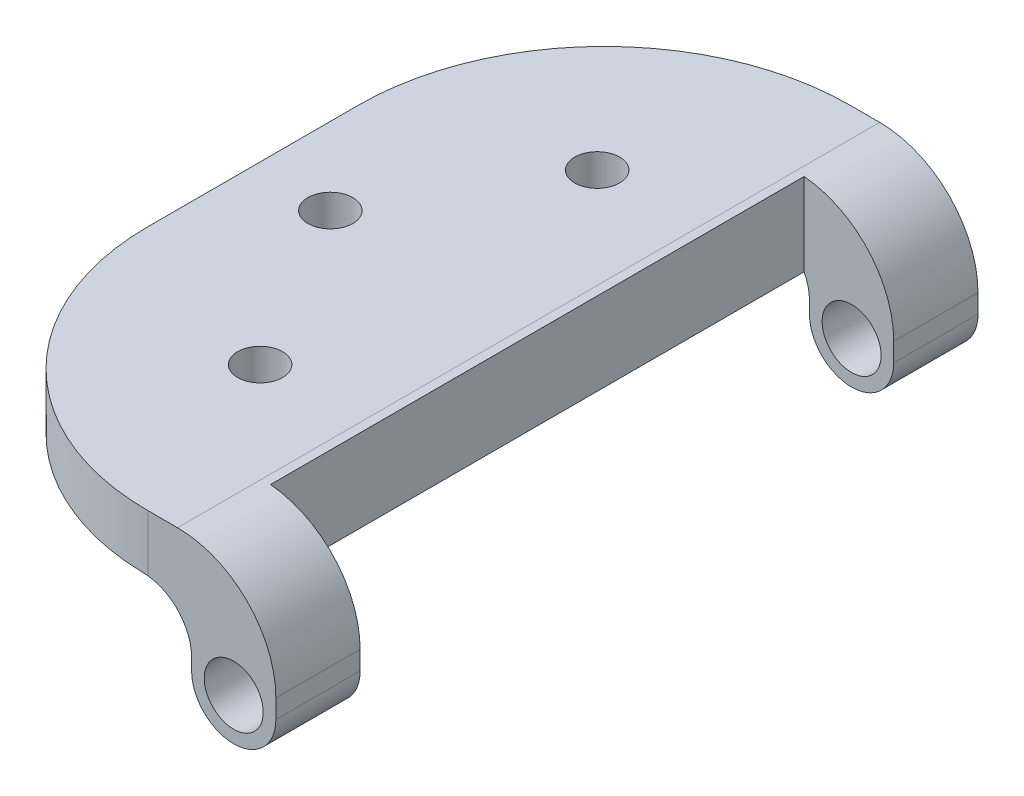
ISO-10303-21;
HEADER;
FILE_DESCRIPTION(('STEP AP214'),'2;1');
FILE_NAME('part.step','',(''),(''),'','','');
FILE_SCHEMA(('AUTOMOTIVE_DESIGN { 1 0 10303 214 1 1 1 1 }'));
ENDSEC;
DATA;
#1=APPLICATION_CONTEXT('core data for automotive mechanical design processes');
#2=APPLICATION_PROTOCOL_DEFINITION('international standard','automotive_design',2000,#1);
#3=PRODUCT_CONTEXT('',#1,'mechanical');
#4=PRODUCT('Part','Part','',(#3));
#5=PRODUCT_RELATED_PRODUCT_CATEGORY('part','',(#4));
#6=PRODUCT_DEFINITION_FORMATION('','',#4);
#7=PRODUCT_DEFINITION_CONTEXT('part definition',#1,'design');
#8=PRODUCT_DEFINITION('design','',#6,#7);
#9=PRODUCT_DEFINITION_SHAPE('','',#8);
#10=(LENGTH_UNIT() NAMED_UNIT(*) SI_UNIT(.MILLI.,.METRE.));
#11=(NAMED_UNIT(*) PLANE_ANGLE_UNIT() SI_UNIT($,.RADIAN.));
#12=(NAMED_UNIT(*) SI_UNIT($,.STERADIAN.) SOLID_ANGLE_UNIT());
#13=UNCERTAINTY_MEASURE_WITH_UNIT(LENGTH_MEASURE(1.E-05),#10,'distance_accuracy_value','');
#14=(GEOMETRIC_REPRESENTATION_CONTEXT(3) GLOBAL_UNCERTAINTY_ASSIGNED_CONTEXT((#13)) GLOBAL_UNIT_ASSIGNED_CONTEXT((#10,
#11,#12)) REPRESENTATION_CONTEXT('',''));
#15=CARTESIAN_POINT('',(0.,0.,0.));
#16=DIRECTION('',(0.,0.,1.));
#17=DIRECTION('',(1.,0.,0.));
#18=AXIS2_PLACEMENT_3D('',#15,#16,#17);
#19=CARTESIAN_POINT('',(6.12,-4.33,-25.));
#20=DIRECTION('',(0.,0.,1.));
#21=DIRECTION('',(1.,0.,0.));
#22=AXIS2_PLACEMENT_3D('',#19,#20,#21);
#23=CYLINDRICAL_SURFACE('',#22,3.);
#24=CARTESIAN_POINT('',(6.12,-4.33,19.));
#25=DIRECTION('',(0.,0.,1.));
#26=DIRECTION('',(1.,0.,0.));
#27=AXIS2_PLACEMENT_3D('',#24,#25,#26);
#28=CIRCLE('',#27,3.);
#29=CARTESIAN_POINT('',(9.12,-4.33,19.));
#30=VERTEX_POINT('',#29);
#31=CARTESIAN_POINT('',(3.12,-4.33,19.));
#32=VERTEX_POINT('',#31);
#33=EDGE_CURVE('E184',#30,#32,#28,.F.);
#34=ORIENTED_EDGE('',*,*,#33,.F.);
#35=DIRECTION('',(0.,0.,1.));
#36=VECTOR('',#35,1.);
#37=CARTESIAN_POINT('',(9.12,-4.33,-25.));
#38=LINE('',#37,#36);
#39=CARTESIAN_POINT('',(9.12,-4.33,25.));
#40=VERTEX_POINT('',#39);
#41=EDGE_CURVE('E224',#30,#40,#38,.T.);
#42=ORIENTED_EDGE('',*,*,#41,.T.);
#43=CARTESIAN_POINT('',(6.12,-4.33,25.));
#44=DIRECTION('',(0.,0.,1.));
#45=DIRECTION('',(1.,0.,0.));
#46=AXIS2_PLACEMENT_3D('',#43,#44,#45);
#47=CIRCLE('',#46,3.);
#48=CARTESIAN_POINT('',(3.12,-4.33,25.));
#49=VERTEX_POINT('',#48);
#50=EDGE_CURVE('E208',#49,#40,#47,.T.);
#51=ORIENTED_EDGE('',*,*,#50,.F.);
#52=DIRECTION('',(0.,0.,1.));
#53=VECTOR('',#52,1.);
#54=CARTESIAN_POINT('',(3.12,-4.33,-25.));
#55=LINE('',#54,#53);
#56=EDGE_CURVE('E243',#32,#49,#55,.T.);
#57=ORIENTED_EDGE('',*,*,#56,.F.);
#58=EDGE_LOOP('',(#34,#42,#51,#57));
#59=FACE_BOUND('',#58,.T.);
#60=ADVANCED_FACE('F39',(#59),#23,.T.);
#61=CARTESIAN_POINT('',(3.12,-4.33,-25.));
#62=DIRECTION('',(-1.,0.,0.));
#63=DIRECTION('',(0.,0.,1.));
#64=AXIS2_PLACEMENT_3D('',#61,#62,#63);
#65=PLANE('',#64);
#66=DIRECTION('',(0.,1.,0.));
#67=VECTOR('',#66,1.);
#68=CARTESIAN_POINT('',(3.12,-4.33,19.));
#69=LINE('',#68,#67);
#70=CARTESIAN_POINT('',(3.12,-3.5,19.));
#71=VERTEX_POINT('',#70);
#72=EDGE_CURVE('E180',#32,#71,#69,.T.);
#73=ORIENTED_EDGE('',*,*,#72,.F.);
#74=ORIENTED_EDGE('',*,*,#56,.T.);
#75=DIRECTION('',(0.,-1.,0.));
#76=VECTOR('',#75,1.);
#77=CARTESIAN_POINT('',(3.12,-4.33,25.));
#78=LINE('',#77,#76);
#79=CARTESIAN_POINT('',(3.12,-3.5,25.));
#80=VERTEX_POINT('',#79);
#81=EDGE_CURVE('E214',#80,#49,#78,.T.);
#82=ORIENTED_EDGE('',*,*,#81,.F.);
#83=DIRECTION('',(0.,0.,1.));
#84=VECTOR('',#83,1.);
#85=CARTESIAN_POINT('',(3.12,-3.5,-25.));
#86=LINE('',#85,#84);
#87=EDGE_CURVE('E322',#80,#71,#86,.F.);
#88=ORIENTED_EDGE('',*,*,#87,.T.);
#89=EDGE_LOOP('',(#73,#74,#82,#88));
#90=FACE_BOUND('',#89,.T.);
#91=ADVANCED_FACE('F393',(#90),#65,.T.);
#92=CARTESIAN_POINT('',(9.12,4.,-25.));
#93=DIRECTION('',(1.,0.,0.));
#94=DIRECTION('',(0.,0.,-1.));
#95=AXIS2_PLACEMENT_3D('',#92,#93,#94);
#96=PLANE('',#95);
#97=DIRECTION('',(0.,-1.,0.));
#98=VECTOR('',#97,1.);
#99=CARTESIAN_POINT('',(9.12,4.,19.));
#100=LINE('',#99,#98);
#101=CARTESIAN_POINT('',(9.12,-3.,19.));
#102=VERTEX_POINT('',#101);
#103=EDGE_CURVE('E191',#102,#30,#100,.T.);
#104=ORIENTED_EDGE('',*,*,#103,.F.);
#105=DIRECTION('',(0.,0.,1.));
#106=VECTOR('',#105,1.);
#107=CARTESIAN_POINT('',(9.12,-3.,25.));
#108=LINE('',#107,#106);
#109=CARTESIAN_POINT('',(9.12,-3.,25.));
#110=VERTEX_POINT('',#109);
#111=EDGE_CURVE('E304',#102,#110,#108,.T.);
#112=ORIENTED_EDGE('',*,*,#111,.T.);
#113=DIRECTION('',(0.,1.,0.));
#114=VECTOR('',#113,1.);
#115=CARTESIAN_POINT('',(9.12,4.,25.));
#116=LINE('',#115,#114);
#117=EDGE_CURVE('E228',#40,#110,#116,.T.);
#118=ORIENTED_EDGE('',*,*,#117,.F.);
#119=ORIENTED_EDGE('',*,*,#41,.F.);
#120=EDGE_LOOP('',(#104,#112,#118,#119));
#121=FACE_BOUND('',#120,.T.);
#122=ADVANCED_FACE('F402',(#121),#96,.T.);
#123=CARTESIAN_POINT('',(6.12,-4.33,-40.));
#124=DIRECTION('',(0.,0.,1.));
#125=DIRECTION('',(1.,0.,0.));
#126=AXIS2_PLACEMENT_3D('',#123,#124,#125);
#127=CYLINDRICAL_SURFACE('',#126,2.1);
#128=CARTESIAN_POINT('',(6.12,-4.33,19.));
#129=DIRECTION('',(0.,0.,1.));
#130=DIRECTION('',(1.,0.,0.));
#131=AXIS2_PLACEMENT_3D('',#128,#129,#130);
#132=CIRCLE('',#131,2.1);
#133=CARTESIAN_POINT('',(8.22,-4.33,19.));
#134=VERTEX_POINT('',#133);
#135=EDGE_CURVE('E196',#134,#134,#132,.F.);
#136=ORIENTED_EDGE('',*,*,#135,.T.);
#137=EDGE_LOOP('',(#136));
#138=FACE_BOUND('',#137,.T.);
#139=CARTESIAN_POINT('',(6.12,-4.33,25.));
#140=DIRECTION('',(0.,0.,1.));
#141=DIRECTION('',(1.,0.,0.));
#142=AXIS2_PLACEMENT_3D('',#139,#140,#141);
#143=CIRCLE('',#142,2.1);
#144=CARTESIAN_POINT('',(8.22,-4.33,25.));
#145=VERTEX_POINT('',#144);
#146=EDGE_CURVE('E200',#145,#145,#143,.T.);
#147=ORIENTED_EDGE('',*,*,#146,.T.);
#148=EDGE_LOOP('',(#147));
#149=FACE_BOUND('',#148,.T.);
#150=ADVANCED_FACE('F453',(#138,#149),#127,.F.);
#151=CARTESIAN_POINT('',(0.,4.,-7.5));
#152=DIRECTION('',(0.,-1.,0.));
#153=DIRECTION('',(0.,0.,-1.));
#154=AXIS2_PLACEMENT_3D('',#151,#152,#153);
#155=PLANE('',#154);
#156=DIRECTION('',(-1.,0.,0.));
#157=VECTOR('',#156,1.);
#158=CARTESIAN_POINT('',(0.,4.,25.));
#159=LINE('',#158,#157);
#160=CARTESIAN_POINT('',(2.12,4.,25.));
#161=VERTEX_POINT('',#160);
#162=CARTESIAN_POINT('',(0.,4.,25.));
#163=VERTEX_POINT('',#162);
#164=EDGE_CURVE('E232',#161,#163,#159,.T.);
#165=ORIENTED_EDGE('',*,*,#164,.F.);
#166=DIRECTION('',(0.,0.,1.));
#167=VECTOR('',#166,1.);
#168=CARTESIAN_POINT('',(2.12,4.,-25.));
#169=LINE('',#168,#167);
#170=CARTESIAN_POINT('',(2.12,4.,-25.));
#171=VERTEX_POINT('',#170);
#172=EDGE_CURVE('E311',#161,#171,#169,.F.);
#173=ORIENTED_EDGE('',*,*,#172,.T.);
#174=DIRECTION('',(-1.,0.,0.));
#175=VECTOR('',#174,1.);
#176=CARTESIAN_POINT('',(0.,4.,-25.));
#177=LINE('',#176,#175);
#178=CARTESIAN_POINT('',(0.,4.,-25.));
#179=VERTEX_POINT('',#178);
#180=EDGE_CURVE('E218',#171,#179,#177,.T.);
#181=ORIENTED_EDGE('',*,*,#180,.T.);
#182=CARTESIAN_POINT('',(0.,4.,-7.5));
#183=DIRECTION('',(0.,1.,0.));
#184=DIRECTION('',(0.,0.,-1.));
#185=AXIS2_PLACEMENT_3D('',#182,#183,#184);
#186=CIRCLE('',#185,17.5);
#187=CARTESIAN_POINT('',(-17.5,4.,-7.49999999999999));
#188=VERTEX_POINT('',#187);
#189=EDGE_CURVE('E272',#179,#188,#186,.T.);
#190=ORIENTED_EDGE('',*,*,#189,.T.);
#191=DIRECTION('',(0.,0.,1.));
#192=VECTOR('',#191,1.);
#193=CARTESIAN_POINT('',(-17.5,4.,0.));
#194=LINE('',#193,#192);
#195=CARTESIAN_POINT('',(-17.5,4.,7.5));
#196=VERTEX_POINT('',#195);
#197=EDGE_CURVE('E275',#188,#196,#194,.T.);
#198=ORIENTED_EDGE('',*,*,#197,.T.);
#199=CARTESIAN_POINT('',(0.,4.,7.49999999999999));
#200=DIRECTION('',(0.,1.,0.));
#201=DIRECTION('',(0.,0.,-1.));
#202=AXIS2_PLACEMENT_3D('',#199,#200,#201);
#203=CIRCLE('',#202,17.5);
#204=EDGE_CURVE('E279',#196,#163,#203,.T.);
#205=ORIENTED_EDGE('',*,*,#204,.T.);
#206=EDGE_LOOP('',(#165,#173,#181,#190,#198,#205));
#207=FACE_BOUND('',#206,.T.);
#208=CARTESIAN_POINT('',(-5.,4.,-12.));
#209=DIRECTION('',(0.,1.,0.));
#210=DIRECTION('',(0.,0.,1.));
#211=AXIS2_PLACEMENT_3D('',#208,#209,#210);
#212=CIRCLE('',#211,1.6);
#213=CARTESIAN_POINT('',(-5.,4.,-10.4));
#214=VERTEX_POINT('',#213);
#215=EDGE_CURVE('E264',#214,#214,#212,.T.);
#216=ORIENTED_EDGE('',*,*,#215,.F.);
#217=EDGE_LOOP('',(#216));
#218=FACE_BOUND('',#217,.T.);
#219=CARTESIAN_POINT('',(-5.,4.,12.));
#220=DIRECTION('',(0.,1.,0.));
#221=DIRECTION('',(0.,0.,1.));
#222=AXIS2_PLACEMENT_3D('',#219,#220,#221);
#223=CIRCLE('',#222,1.6);
#224=CARTESIAN_POINT('',(-5.,4.,13.6));
#225=VERTEX_POINT('',#224);
#226=EDGE_CURVE('E256',#225,#225,#223,.T.);
#227=ORIENTED_EDGE('',*,*,#226,.F.);
#228=EDGE_LOOP('',(#227));
#229=FACE_BOUND('',#228,.T.);
#230=CARTESIAN_POINT('',(-11.9999999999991,4.,-1.37310539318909E-13));
#231=DIRECTION('',(0.,1.,0.));
#232=DIRECTION('',(0.,0.,1.));
#233=AXIS2_PLACEMENT_3D('',#230,#231,#232);
#234=CIRCLE('',#233,1.5999999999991);
#235=CARTESIAN_POINT('',(-11.9999999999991,4.,1.59999999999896));
#236=VERTEX_POINT('',#235);
#237=EDGE_CURVE('E248',#236,#236,#234,.T.);
#238=ORIENTED_EDGE('',*,*,#237,.F.);
#239=EDGE_LOOP('',(#238));
#240=FACE_BOUND('',#239,.T.);
#241=ADVANCED_FACE('F425',(#207,#218,#229,#240),#155,.F.);
#242=CARTESIAN_POINT('',(0.,0.,-7.5));
#243=DIRECTION('',(0.,-1.,0.));
#244=DIRECTION('',(0.,0.,-1.));
#245=AXIS2_PLACEMENT_3D('',#242,#243,#244);
#246=PLANE('',#245);
#247=CARTESIAN_POINT('',(-5.,0.,12.));
#248=DIRECTION('',(0.,1.,0.));
#249=DIRECTION('',(0.,0.,1.));
#250=AXIS2_PLACEMENT_3D('',#247,#248,#249);
#251=CIRCLE('',#250,1.6);
#252=CARTESIAN_POINT('',(-5.,0.,13.6));
#253=VERTEX_POINT('',#252);
#254=EDGE_CURVE('E252',#253,#253,#251,.T.);
#255=ORIENTED_EDGE('',*,*,#254,.T.);
#256=EDGE_LOOP('',(#255));
#257=FACE_BOUND('',#256,.T.);
#258=CARTESIAN_POINT('',(0.,0.,-7.5));
#259=DIRECTION('',(0.,1.,0.));
#260=DIRECTION('',(0.,0.,-1.));
#261=AXIS2_PLACEMENT_3D('',#258,#259,#260);
#262=CIRCLE('',#261,17.5);
#263=CARTESIAN_POINT('',(-0.379999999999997,0.,-24.9958737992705));
#264=VERTEX_POINT('',#263);
#265=CARTESIAN_POINT('',(-17.5,0.,-7.49999999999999));
#266=VERTEX_POINT('',#265);
#267=EDGE_CURVE('E268',#264,#266,#262,.T.);
#268=ORIENTED_EDGE('',*,*,#267,.F.);
#269=DIRECTION('',(0.,0.,1.));
#270=VECTOR('',#269,1.);
#271=CARTESIAN_POINT('',(-0.379999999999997,0.,25.));
#272=LINE('',#271,#270);
#273=CARTESIAN_POINT('',(-0.379999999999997,0.,24.9958737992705));
#274=VERTEX_POINT('',#273);
#275=EDGE_CURVE('E317',#264,#274,#272,.T.);
#276=ORIENTED_EDGE('',*,*,#275,.T.);
#277=CARTESIAN_POINT('',(0.,0.,7.49999999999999));
#278=DIRECTION('',(0.,1.,0.));
#279=DIRECTION('',(0.,0.,-1.));
#280=AXIS2_PLACEMENT_3D('',#277,#278,#279);
#281=CIRCLE('',#280,17.5);
#282=CARTESIAN_POINT('',(-17.5,0.,7.5));
#283=VERTEX_POINT('',#282);
#284=EDGE_CURVE('E276',#283,#274,#281,.T.);
#285=ORIENTED_EDGE('',*,*,#284,.F.);
#286=DIRECTION('',(0.,0.,1.));
#287=VECTOR('',#286,1.);
#288=CARTESIAN_POINT('',(-17.5,0.,7.5));
#289=LINE('',#288,#287);
#290=EDGE_CURVE('E286',#266,#283,#289,.T.);
#291=ORIENTED_EDGE('',*,*,#290,.F.);
#292=EDGE_LOOP('',(#268,#276,#285,#291));
#293=FACE_BOUND('',#292,.T.);
#294=CARTESIAN_POINT('',(-5.,0.,-12.));
#295=DIRECTION('',(0.,1.,0.));
#296=DIRECTION('',(0.,0.,1.));
#297=AXIS2_PLACEMENT_3D('',#294,#295,#296);
#298=CIRCLE('',#297,1.6);
#299=CARTESIAN_POINT('',(-5.,0.,-10.4));
#300=VERTEX_POINT('',#299);
#301=EDGE_CURVE('E260',#300,#300,#298,.T.);
#302=ORIENTED_EDGE('',*,*,#301,.T.);
#303=EDGE_LOOP('',(#302));
#304=FACE_BOUND('',#303,.T.);
#305=CARTESIAN_POINT('',(-11.9999999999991,0.,-1.37310539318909E-13));
#306=DIRECTION('',(0.,1.,0.));
#307=DIRECTION('',(0.,0.,1.));
#308=AXIS2_PLACEMENT_3D('',#305,#306,#307);
#309=CIRCLE('',#308,1.5999999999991);
#310=CARTESIAN_POINT('',(-11.9999999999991,0.,1.59999999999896));
#311=VERTEX_POINT('',#310);
#312=EDGE_CURVE('E242',#311,#311,#309,.T.);
#313=ORIENTED_EDGE('',*,*,#312,.T.);
#314=EDGE_LOOP('',(#313));
#315=FACE_BOUND('',#314,.T.);
#316=ADVANCED_FACE('F345',(#257,#293,#304,#315),#246,.T.);
#317=CARTESIAN_POINT('',(0.,4.,-7.5));
#318=DIRECTION('',(0.,-1.,0.));
#319=DIRECTION('',(0.,0.,-1.));
#320=AXIS2_PLACEMENT_3D('',#317,#318,#319);
#321=CYLINDRICAL_SURFACE('',#320,17.5);
#322=DIRECTION('',(0.,-1.,0.));
#323=VECTOR('',#322,1.);
#324=CARTESIAN_POINT('',(0.,4.,-25.));
#325=LINE('',#324,#323);
#326=CARTESIAN_POINT('',(0.,-0.0206897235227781,-25.));
#327=VERTEX_POINT('',#326);
#328=EDGE_CURVE('E64',#179,#327,#325,.T.);
#329=ORIENTED_EDGE('',*,*,#328,.T.);
#330=CARTESIAN_POINT('',(0.,-0.0206897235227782,-25.));
#331=CARTESIAN_POINT('',(-0.0631531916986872,-0.0137952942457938,-25.0000020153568));
#332=CARTESIAN_POINT('',(-0.126396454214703,-0.00862393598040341,-24.9996591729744));
#333=CARTESIAN_POINT('',(-0.253063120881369,-0.00172736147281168,-24.9982837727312));
#334=CARTESIAN_POINT('',(-0.316486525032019,-2.14523060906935E-06,-24.9972512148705));
#335=CARTESIAN_POINT('',(-0.379999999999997,0.,-24.9958737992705));
#336=B_SPLINE_CURVE_WITH_KNOTS('',3,(#330,#331,#332,#333,#334,#335),.UNSPECIFIED.,.F.,.F.,(4,2,
4),(0.,0.190365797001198,0.380731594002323),.UNSPECIFIED.);
#337=EDGE_CURVE('E354',#327,#264,#336,.T.);
#338=ORIENTED_EDGE('',*,*,#337,.T.);
#339=ORIENTED_EDGE('',*,*,#267,.T.);
#340=DIRECTION('',(0.,-1.,0.));
#341=VECTOR('',#340,1.);
#342=CARTESIAN_POINT('',(-17.5,4.,-7.49999999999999));
#343=LINE('',#342,#341);
#344=EDGE_CURVE('E298',#188,#266,#343,.T.);
#345=ORIENTED_EDGE('',*,*,#344,.F.);
#346=ORIENTED_EDGE('',*,*,#189,.F.);
#347=EDGE_LOOP('',(#329,#338,#339,#345,#346));
#348=FACE_BOUND('',#347,.T.);
#349=ADVANCED_FACE('F349',(#348),#321,.T.);
#350=CARTESIAN_POINT('',(-17.5,4.,7.5));
#351=DIRECTION('',(1.,0.,0.));
#352=DIRECTION('',(0.,0.,-1.));
#353=AXIS2_PLACEMENT_3D('',#350,#351,#352);
#354=PLANE('',#353);
#355=ORIENTED_EDGE('',*,*,#290,.T.);
#356=DIRECTION('',(0.,-1.,0.));
#357=VECTOR('',#356,1.);
#358=CARTESIAN_POINT('',(-17.5,4.,7.5));
#359=LINE('',#358,#357);
#360=EDGE_CURVE('E294',#196,#283,#359,.T.);
#361=ORIENTED_EDGE('',*,*,#360,.F.);
#362=ORIENTED_EDGE('',*,*,#197,.F.);
#363=ORIENTED_EDGE('',*,*,#344,.T.);
#364=EDGE_LOOP('',(#355,#361,#362,#363));
#365=FACE_BOUND('',#364,.T.);
#366=ADVANCED_FACE('F343',(#365),#354,.F.);
#367=CARTESIAN_POINT('',(0.,4.,7.49999999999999));
#368=DIRECTION('',(0.,-1.,0.));
#369=DIRECTION('',(0.,0.,-1.));
#370=AXIS2_PLACEMENT_3D('',#367,#368,#369);
#371=CYLINDRICAL_SURFACE('',#370,17.5);
#372=ORIENTED_EDGE('',*,*,#284,.T.);
#373=CARTESIAN_POINT('',(-0.379999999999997,0.,24.9958737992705));
#374=CARTESIAN_POINT('',(-0.316486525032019,-2.14523060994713E-06,24.9972512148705));
#375=CARTESIAN_POINT('',(-0.253063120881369,-0.00172736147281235,24.9982837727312));
#376=CARTESIAN_POINT('',(-0.126396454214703,-0.00862393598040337,24.9996591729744));
#377=CARTESIAN_POINT('',(-0.0631531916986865,-0.0137952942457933,25.0000020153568));
#378=CARTESIAN_POINT('',(0.,-0.020689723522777,25.));
#379=B_SPLINE_CURVE_WITH_KNOTS('',3,(#373,#374,#375,#376,#377,#378),.UNSPECIFIED.,.F.,.F.,(4,2,
4),(0.,0.190365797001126,0.380731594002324),.UNSPECIFIED.);
#380=CARTESIAN_POINT('',(0.,-0.0206897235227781,25.));
#381=VERTEX_POINT('',#380);
#382=EDGE_CURVE('E326',#274,#381,#379,.T.);
#383=ORIENTED_EDGE('',*,*,#382,.T.);
#384=DIRECTION('',(0.,-1.,0.));
#385=VECTOR('',#384,1.);
#386=CARTESIAN_POINT('',(0.,4.,25.));
#387=LINE('',#386,#385);
#388=EDGE_CURVE('E283',#163,#381,#387,.T.);
#389=ORIENTED_EDGE('',*,*,#388,.F.);
#390=ORIENTED_EDGE('',*,*,#204,.F.);
#391=ORIENTED_EDGE('',*,*,#360,.T.);
#392=EDGE_LOOP('',(#372,#383,#389,#390,#391));
#393=FACE_BOUND('',#392,.T.);
#394=ADVANCED_FACE('F337',(#393),#371,.T.);
#395=CARTESIAN_POINT('',(-5.,4.,-12.));
#396=DIRECTION('',(0.,-1.,0.));
#397=DIRECTION('',(0.,0.,-1.));
#398=AXIS2_PLACEMENT_3D('',#395,#396,#397);
#399=CYLINDRICAL_SURFACE('',#398,1.6);
#400=ORIENTED_EDGE('',*,*,#215,.T.);
#401=EDGE_LOOP('',(#400));
#402=FACE_BOUND('',#401,.T.);
#403=ORIENTED_EDGE('',*,*,#301,.F.);
#404=EDGE_LOOP('',(#403));
#405=FACE_BOUND('',#404,.T.);
#406=ADVANCED_FACE('F342',(#402,#405),#399,.F.);
#407=CARTESIAN_POINT('',(-5.,4.,12.));
#408=DIRECTION('',(0.,-1.,0.));
#409=DIRECTION('',(0.,0.,-1.));
#410=AXIS2_PLACEMENT_3D('',#407,#408,#409);
#411=CYLINDRICAL_SURFACE('',#410,1.6);
#412=ORIENTED_EDGE('',*,*,#226,.T.);
#413=EDGE_LOOP('',(#412));
#414=FACE_BOUND('',#413,.T.);
#415=ORIENTED_EDGE('',*,*,#254,.F.);
#416=EDGE_LOOP('',(#415));
#417=FACE_BOUND('',#416,.T.);
#418=ADVANCED_FACE('F442',(#414,#417),#411,.F.);
#419=CARTESIAN_POINT('',(-11.9999999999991,4.,-1.37310539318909E-13));
#420=DIRECTION('',(0.,-1.,0.));
#421=DIRECTION('',(0.,0.,-1.));
#422=AXIS2_PLACEMENT_3D('',#419,#420,#421);
#423=CYLINDRICAL_SURFACE('',#422,1.5999999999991);
#424=ORIENTED_EDGE('',*,*,#237,.T.);
#425=EDGE_LOOP('',(#424));
#426=FACE_BOUND('',#425,.T.);
#427=ORIENTED_EDGE('',*,*,#312,.F.);
#428=EDGE_LOOP('',(#427));
#429=FACE_BOUND('',#428,.T.);
#430=ADVANCED_FACE('F435',(#426,#429),#423,.F.);
#431=CARTESIAN_POINT('',(6.12,-4.33,-19.));
#432=DIRECTION('',(0.,0.,-1.));
#433=DIRECTION('',(-1.,0.,0.));
#434=AXIS2_PLACEMENT_3D('',#431,#432,#433);
#435=CIRCLE('',#434,3.);
#436=CARTESIAN_POINT('',(3.12,-4.33,-19.));
#437=VERTEX_POINT('',#436);
#438=CARTESIAN_POINT('',(9.12,-4.33,-19.));
#439=VERTEX_POINT('',#438);
#440=EDGE_CURVE('E377',#437,#439,#435,.F.);
#441=ORIENTED_EDGE('',*,*,#440,.F.);
#442=CARTESIAN_POINT('',(3.12,-4.33,-25.));
#443=VERTEX_POINT('',#442);
#444=EDGE_CURVE('E238',#443,#437,#55,.T.);
#445=ORIENTED_EDGE('',*,*,#444,.F.);
#446=CARTESIAN_POINT('',(6.12,-4.33,-25.));
#447=DIRECTION('',(0.,0.,1.));
#448=DIRECTION('',(1.,0.,0.));
#449=AXIS2_PLACEMENT_3D('',#446,#447,#448);
#450=CIRCLE('',#449,3.);
#451=CARTESIAN_POINT('',(9.12,-4.33,-25.));
#452=VERTEX_POINT('',#451);
#453=EDGE_CURVE('E209',#443,#452,#450,.T.);
#454=ORIENTED_EDGE('',*,*,#453,.T.);
#455=EDGE_CURVE('E244',#452,#439,#38,.T.);
#456=ORIENTED_EDGE('',*,*,#455,.T.);
#457=EDGE_LOOP('',(#441,#445,#454,#456));
#458=FACE_BOUND('',#457,.T.);
#459=ADVANCED_FACE('F433',(#458),#23,.T.);
#460=DIRECTION('',(0.,-1.,0.));
#461=VECTOR('',#460,1.);
#462=CARTESIAN_POINT('',(3.12,-4.33,-19.));
#463=LINE('',#462,#461);
#464=CARTESIAN_POINT('',(3.12,-3.5,-19.));
#465=VERTEX_POINT('',#464);
#466=EDGE_CURVE('E370',#465,#437,#463,.T.);
#467=ORIENTED_EDGE('',*,*,#466,.F.);
#468=CARTESIAN_POINT('',(3.12,-3.5,-25.));
#469=VERTEX_POINT('',#468);
#470=EDGE_CURVE('E321',#465,#469,#86,.F.);
#471=ORIENTED_EDGE('',*,*,#470,.T.);
#472=DIRECTION('',(0.,-1.,0.));
#473=VECTOR('',#472,1.);
#474=CARTESIAN_POINT('',(3.12,-4.33,-25.));
#475=LINE('',#474,#473);
#476=EDGE_CURVE('E221',#469,#443,#475,.T.);
#477=ORIENTED_EDGE('',*,*,#476,.T.);
#478=ORIENTED_EDGE('',*,*,#444,.T.);
#479=EDGE_LOOP('',(#467,#471,#477,#478));
#480=FACE_BOUND('',#479,.T.);
#481=ADVANCED_FACE('F373',(#480),#65,.T.);
#482=DIRECTION('',(0.,1.,0.));
#483=VECTOR('',#482,1.);
#484=CARTESIAN_POINT('',(9.12,4.,-19.));
#485=LINE('',#484,#483);
#486=CARTESIAN_POINT('',(9.12,-3.,-19.));
#487=VERTEX_POINT('',#486);
#488=EDGE_CURVE('E157',#439,#487,#485,.T.);
#489=ORIENTED_EDGE('',*,*,#488,.F.);
#490=ORIENTED_EDGE('',*,*,#455,.F.);
#491=DIRECTION('',(0.,1.,0.));
#492=VECTOR('',#491,1.);
#493=CARTESIAN_POINT('',(9.12,4.,-25.));
#494=LINE('',#493,#492);
#495=CARTESIAN_POINT('',(9.12,-3.,-25.));
#496=VERTEX_POINT('',#495);
#497=EDGE_CURVE('E213',#452,#496,#494,.T.);
#498=ORIENTED_EDGE('',*,*,#497,.T.);
#499=EDGE_CURVE('E305',#496,#487,#108,.T.);
#500=ORIENTED_EDGE('',*,*,#499,.T.);
#501=EDGE_LOOP('',(#489,#490,#498,#500));
#502=FACE_BOUND('',#501,.T.);
#503=ADVANCED_FACE('F431',(#502),#96,.T.);
#504=CARTESIAN_POINT('',(6.12,-4.33,-25.));
#505=DIRECTION('',(0.,0.,1.));
#506=DIRECTION('',(1.,0.,0.));
#507=AXIS2_PLACEMENT_3D('',#504,#505,#506);
#508=PLANE('',#507);
#509=CARTESIAN_POINT('',(6.12,-4.33,-25.));
#510=DIRECTION('',(0.,0.,1.));
#511=DIRECTION('',(1.,0.,0.));
#512=AXIS2_PLACEMENT_3D('',#509,#510,#511);
#513=CIRCLE('',#512,2.1);
#514=CARTESIAN_POINT('',(8.22,-4.33,-25.));
#515=VERTEX_POINT('',#514);
#516=EDGE_CURVE('E204',#515,#515,#513,.T.);
#517=ORIENTED_EDGE('',*,*,#516,.T.);
#518=EDGE_LOOP('',(#517));
#519=FACE_BOUND('',#518,.T.);
#520=ORIENTED_EDGE('',*,*,#180,.F.);
#521=CARTESIAN_POINT('',(2.12,-3.,-25.));
#522=DIRECTION('',(0.,0.,1.));
#523=DIRECTION('',(1.,0.,0.));
#524=AXIS2_PLACEMENT_3D('',#521,#522,#523);
#525=CIRCLE('',#524,7.);
#526=EDGE_CURVE('E314',#171,#496,#525,.F.);
#527=ORIENTED_EDGE('',*,*,#526,.T.);
#528=ORIENTED_EDGE('',*,*,#497,.F.);
#529=ORIENTED_EDGE('',*,*,#453,.F.);
#530=ORIENTED_EDGE('',*,*,#476,.F.);
#531=CARTESIAN_POINT('',(-0.379999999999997,-3.5,-25.));
#532=DIRECTION('',(0.,0.,1.));
#533=DIRECTION('',(1.,0.,0.));
#534=AXIS2_PLACEMENT_3D('',#531,#532,#533);
#535=CIRCLE('',#534,3.5);
#536=EDGE_CURVE('E362',#469,#327,#535,.T.);
#537=ORIENTED_EDGE('',*,*,#536,.T.);
#538=ORIENTED_EDGE('',*,*,#328,.F.);
#539=EDGE_LOOP('',(#520,#527,#528,#529,#530,#537,#538));
#540=FACE_BOUND('',#539,.T.);
#541=ADVANCED_FACE('F413',(#519,#540),#508,.F.);
#542=CARTESIAN_POINT('',(6.12,-4.33,25.));
#543=DIRECTION('',(0.,0.,1.));
#544=DIRECTION('',(1.,0.,0.));
#545=AXIS2_PLACEMENT_3D('',#542,#543,#544);
#546=PLANE('',#545);
#547=ORIENTED_EDGE('',*,*,#146,.F.);
#548=EDGE_LOOP('',(#547));
#549=FACE_BOUND('',#548,.T.);
#550=ORIENTED_EDGE('',*,*,#117,.T.);
#551=CARTESIAN_POINT('',(2.12,-3.,25.));
#552=DIRECTION('',(0.,0.,1.));
#553=DIRECTION('',(1.,0.,0.));
#554=AXIS2_PLACEMENT_3D('',#551,#552,#553);
#555=CIRCLE('',#554,7.);
#556=EDGE_CURVE('E308',#110,#161,#555,.T.);
#557=ORIENTED_EDGE('',*,*,#556,.T.);
#558=ORIENTED_EDGE('',*,*,#164,.T.);
#559=ORIENTED_EDGE('',*,*,#388,.T.);
#560=CARTESIAN_POINT('',(-0.379999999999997,-3.5,25.));
#561=DIRECTION('',(0.,0.,1.));
#562=DIRECTION('',(1.,0.,0.));
#563=AXIS2_PLACEMENT_3D('',#560,#561,#562);
#564=CIRCLE('',#563,3.5);
#565=EDGE_CURVE('E335',#381,#80,#564,.F.);
#566=ORIENTED_EDGE('',*,*,#565,.T.);
#567=ORIENTED_EDGE('',*,*,#81,.T.);
#568=ORIENTED_EDGE('',*,*,#50,.T.);
#569=EDGE_LOOP('',(#550,#557,#558,#559,#566,#567,#568));
#570=FACE_BOUND('',#569,.T.);
#571=ADVANCED_FACE('F405',(#549,#570),#546,.T.);
#572=CARTESIAN_POINT('',(6.12,-4.33,-19.));
#573=DIRECTION('',(0.,0.,-1.));
#574=DIRECTION('',(-1.,0.,0.));
#575=AXIS2_PLACEMENT_3D('',#572,#573,#574);
#576=CIRCLE('',#575,2.1);
#577=CARTESIAN_POINT('',(4.02,-4.33,-19.));
#578=VERTEX_POINT('',#577);
#579=EDGE_CURVE('E163',#578,#578,#576,.F.);
#580=ORIENTED_EDGE('',*,*,#579,.T.);
#581=EDGE_LOOP('',(#580));
#582=FACE_BOUND('',#581,.T.);
#583=ORIENTED_EDGE('',*,*,#516,.F.);
#584=EDGE_LOOP('',(#583));
#585=FACE_BOUND('',#584,.T.);
#586=ADVANCED_FACE('F464',(#582,#585),#127,.F.);
#587=CARTESIAN_POINT('',(2.12,-3.,-25.));
#588=DIRECTION('',(0.,0.,-1.));
#589=DIRECTION('',(-1.,0.,0.));
#590=AXIS2_PLACEMENT_3D('',#587,#588,#589);
#591=CYLINDRICAL_SURFACE('',#590,7.);
#592=CARTESIAN_POINT('',(2.12,-3.,19.));
#593=DIRECTION('',(0.,0.,1.));
#594=DIRECTION('',(1.,0.,0.));
#595=AXIS2_PLACEMENT_3D('',#592,#593,#594);
#596=CIRCLE('',#595,7.);
#597=CARTESIAN_POINT('',(2.73858577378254,3.97261440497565,19.));
#598=VERTEX_POINT('',#597);
#599=EDGE_CURVE('E178',#598,#102,#596,.F.);
#600=ORIENTED_EDGE('',*,*,#599,.F.);
#601=DIRECTION('',(0.,0.,-1.));
#602=VECTOR('',#601,1.);
#603=CARTESIAN_POINT('',(2.73858577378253,3.97261440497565,-25.));
#604=LINE('',#603,#602);
#605=CARTESIAN_POINT('',(2.73858577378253,3.97261440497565,-19.));
#606=VERTEX_POINT('',#605);
#607=EDGE_CURVE('E168',#606,#598,#604,.F.);
#608=ORIENTED_EDGE('',*,*,#607,.F.);
#609=CARTESIAN_POINT('',(2.12,-3.,-19.));
#610=DIRECTION('',(0.,0.,-1.));
#611=DIRECTION('',(-1.,0.,0.));
#612=AXIS2_PLACEMENT_3D('',#609,#610,#611);
#613=CIRCLE('',#612,7.);
#614=EDGE_CURVE('E153',#487,#606,#613,.F.);
#615=ORIENTED_EDGE('',*,*,#614,.F.);
#616=ORIENTED_EDGE('',*,*,#499,.F.);
#617=ORIENTED_EDGE('',*,*,#526,.F.);
#618=ORIENTED_EDGE('',*,*,#172,.F.);
#619=ORIENTED_EDGE('',*,*,#556,.F.);
#620=ORIENTED_EDGE('',*,*,#111,.F.);
#621=EDGE_LOOP('',(#600,#608,#615,#616,#617,#618,#619,#620));
#622=FACE_BOUND('',#621,.T.);
#623=ADVANCED_FACE('F176',(#622),#591,.T.);
#624=CARTESIAN_POINT('',(-0.379999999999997,-3.5,-7.5));
#625=DIRECTION('',(0.,0.,-1.));
#626=DIRECTION('',(-1.,0.,0.));
#627=AXIS2_PLACEMENT_3D('',#624,#625,#626);
#628=CYLINDRICAL_SURFACE('',#627,3.5);
#629=DIRECTION('',(0.,0.,-1.));
#630=VECTOR('',#629,1.);
#631=CARTESIAN_POINT('',(2.73858577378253,-1.91115678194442,-7.5));
#632=LINE('',#631,#630);
#633=CARTESIAN_POINT('',(2.73858577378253,-1.91115678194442,-19.));
#634=VERTEX_POINT('',#633);
#635=CARTESIAN_POINT('',(2.73858577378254,-1.91115678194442,19.));
#636=VERTEX_POINT('',#635);
#637=EDGE_CURVE('E49',#634,#636,#632,.F.);
#638=ORIENTED_EDGE('',*,*,#637,.T.);
#639=CARTESIAN_POINT('',(-0.379999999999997,-3.5,19.));
#640=DIRECTION('',(0.,0.,1.));
#641=DIRECTION('',(1.,0.,0.));
#642=AXIS2_PLACEMENT_3D('',#639,#640,#641);
#643=CIRCLE('',#642,3.5);
#644=EDGE_CURVE('E11',#636,#71,#643,.F.);
#645=ORIENTED_EDGE('',*,*,#644,.T.);
#646=ORIENTED_EDGE('',*,*,#87,.F.);
#647=ORIENTED_EDGE('',*,*,#565,.F.);
#648=ORIENTED_EDGE('',*,*,#382,.F.);
#649=ORIENTED_EDGE('',*,*,#275,.F.);
#650=ORIENTED_EDGE('',*,*,#337,.F.);
#651=ORIENTED_EDGE('',*,*,#536,.F.);
#652=ORIENTED_EDGE('',*,*,#470,.F.);
#653=CARTESIAN_POINT('',(-0.379999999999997,-3.5,-19.));
#654=DIRECTION('',(0.,0.,-1.));
#655=DIRECTION('',(-1.,0.,0.));
#656=AXIS2_PLACEMENT_3D('',#653,#654,#655);
#657=CIRCLE('',#656,3.5);
#658=EDGE_CURVE('E361',#465,#634,#657,.F.);
#659=ORIENTED_EDGE('',*,*,#658,.T.);
#660=EDGE_LOOP('',(#638,#645,#646,#647,#648,#649,#650,#651,#652,#659));
#661=FACE_BOUND('',#660,.T.);
#662=ADVANCED_FACE('F41',(#661),#628,.F.);
#663=CARTESIAN_POINT('',(2.73858577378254,-61.,19.));
#664=DIRECTION('',(0.,0.,1.));
#665=DIRECTION('',(1.,0.,0.));
#666=AXIS2_PLACEMENT_3D('',#663,#664,#665);
#667=PLANE('',#666);
#668=ORIENTED_EDGE('',*,*,#599,.T.);
#669=ORIENTED_EDGE('',*,*,#103,.T.);
#670=ORIENTED_EDGE('',*,*,#33,.T.);
#671=ORIENTED_EDGE('',*,*,#72,.T.);
#672=ORIENTED_EDGE('',*,*,#644,.F.);
#673=DIRECTION('',(0.,1.,0.));
#674=VECTOR('',#673,1.);
#675=CARTESIAN_POINT('',(2.73858577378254,-61.,19.));
#676=LINE('',#675,#674);
#677=EDGE_CURVE('E173',#636,#598,#676,.T.);
#678=ORIENTED_EDGE('',*,*,#677,.T.);
#679=EDGE_LOOP('',(#668,#669,#670,#671,#672,#678));
#680=FACE_BOUND('',#679,.T.);
#681=ORIENTED_EDGE('',*,*,#135,.F.);
#682=EDGE_LOOP('',(#681));
#683=FACE_BOUND('',#682,.T.);
#684=ADVANCED_FACE('F386',(#680,#683),#667,.F.);
#685=CARTESIAN_POINT('',(2.73858577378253,-61.,-19.));
#686=DIRECTION('',(-1.,0.,0.));
#687=DIRECTION('',(0.,0.,1.));
#688=AXIS2_PLACEMENT_3D('',#685,#686,#687);
#689=PLANE('',#688);
#690=ORIENTED_EDGE('',*,*,#607,.T.);
#691=ORIENTED_EDGE('',*,*,#677,.F.);
#692=ORIENTED_EDGE('',*,*,#637,.F.);
#693=DIRECTION('',(0.,1.,0.));
#694=VECTOR('',#693,1.);
#695=CARTESIAN_POINT('',(2.73858577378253,-61.,-19.));
#696=LINE('',#695,#694);
#697=EDGE_CURVE('E56',#634,#606,#696,.T.);
#698=ORIENTED_EDGE('',*,*,#697,.T.);
#699=EDGE_LOOP('',(#690,#691,#692,#698));
#700=FACE_BOUND('',#699,.T.);
#701=ADVANCED_FACE('F166',(#700),#689,.F.);
#702=CARTESIAN_POINT('',(12.1954623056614,-61.,-19.));
#703=DIRECTION('',(0.,0.,-1.));
#704=DIRECTION('',(-1.,0.,0.));
#705=AXIS2_PLACEMENT_3D('',#702,#703,#704);
#706=PLANE('',#705);
#707=ORIENTED_EDGE('',*,*,#614,.T.);
#708=ORIENTED_EDGE('',*,*,#697,.F.);
#709=ORIENTED_EDGE('',*,*,#658,.F.);
#710=ORIENTED_EDGE('',*,*,#466,.T.);
#711=ORIENTED_EDGE('',*,*,#440,.T.);
#712=ORIENTED_EDGE('',*,*,#488,.T.);
#713=EDGE_LOOP('',(#707,#708,#709,#710,#711,#712));
#714=FACE_BOUND('',#713,.T.);
#715=ORIENTED_EDGE('',*,*,#579,.F.);
#716=EDGE_LOOP('',(#715));
#717=FACE_BOUND('',#716,.T.);
#718=ADVANCED_FACE('F154',(#714,#717),#706,.F.);
#719=CLOSED_SHELL('',(#60,#91,#122,#150,#241,#316,#349,#366,#394,#406,#418,#430,#459,#481,#503,
#541,#571,#586,#623,#662,#684,#701,#718));
#720=MANIFOLD_SOLID_BREP('B2',#719);
#721=ADVANCED_BREP_SHAPE_REPRESENTATION('',(#18,#720),#14);
#722=SHAPE_DEFINITION_REPRESENTATION(#9,#721);
ENDSEC;
END-ISO-10303-21;
